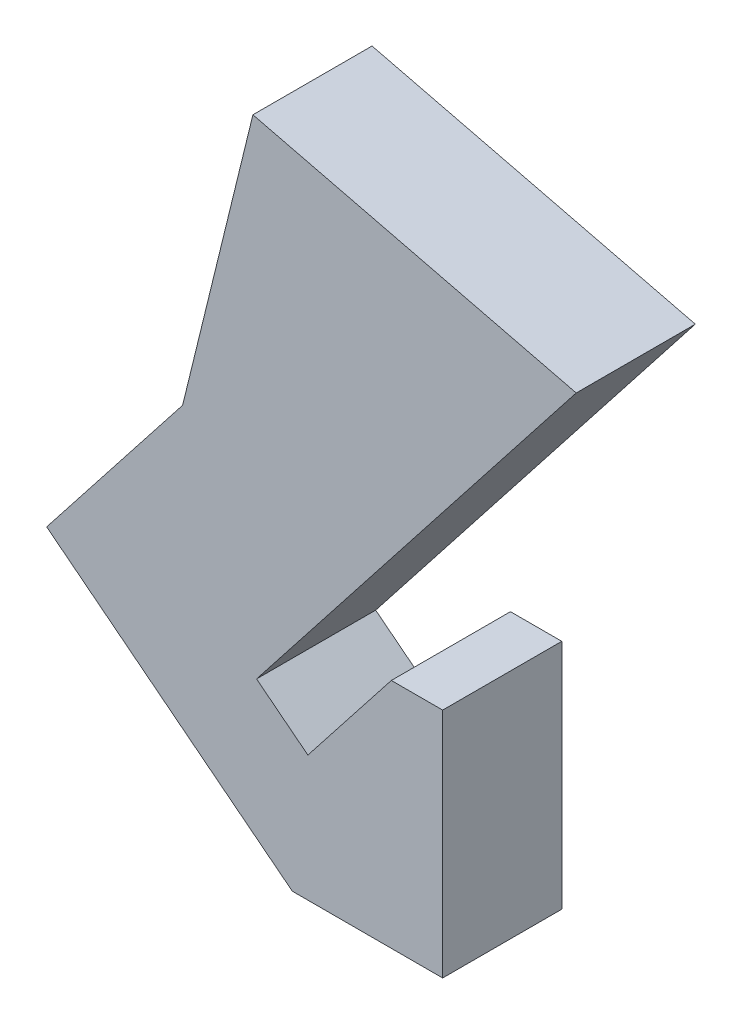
ISO-10303-21;
HEADER;
FILE_DESCRIPTION(('STEP AP214'),'2;1');
FILE_NAME('part.step','',(''),(''),'','','');
FILE_SCHEMA(('AUTOMOTIVE_DESIGN { 1 0 10303 214 1 1 1 1 }'));
ENDSEC;
DATA;
#1=APPLICATION_CONTEXT('core data for automotive mechanical design processes');
#2=APPLICATION_PROTOCOL_DEFINITION('international standard','automotive_design',2000,#1);
#3=PRODUCT_CONTEXT('',#1,'mechanical');
#4=PRODUCT('Part','Part','',(#3));
#5=PRODUCT_RELATED_PRODUCT_CATEGORY('part','',(#4));
#6=PRODUCT_DEFINITION_FORMATION('','',#4);
#7=PRODUCT_DEFINITION_CONTEXT('part definition',#1,'design');
#8=PRODUCT_DEFINITION('design','',#6,#7);
#9=PRODUCT_DEFINITION_SHAPE('','',#8);
#10=(LENGTH_UNIT() NAMED_UNIT(*) SI_UNIT(.MILLI.,.METRE.));
#11=(NAMED_UNIT(*) PLANE_ANGLE_UNIT() SI_UNIT($,.RADIAN.));
#12=(NAMED_UNIT(*) SI_UNIT($,.STERADIAN.) SOLID_ANGLE_UNIT());
#13=UNCERTAINTY_MEASURE_WITH_UNIT(LENGTH_MEASURE(1.E-05),#10,'distance_accuracy_value','');
#14=(GEOMETRIC_REPRESENTATION_CONTEXT(3) GLOBAL_UNCERTAINTY_ASSIGNED_CONTEXT((#13)) GLOBAL_UNIT_ASSIGNED_CONTEXT((#10,
#11,#12)) REPRESENTATION_CONTEXT('',''));
#15=CARTESIAN_POINT('',(0.,0.,0.));
#16=DIRECTION('',(0.,0.,1.));
#17=DIRECTION('',(1.,0.,0.));
#18=AXIS2_PLACEMENT_3D('',#15,#16,#17);
#19=CARTESIAN_POINT('',(0.,11.3792,5.842));
#20=DIRECTION('',(-1.,0.,0.));
#21=DIRECTION('',(0.,-1.,0.));
#22=AXIS2_PLACEMENT_3D('',#19,#20,#21);
#23=PLANE('',#22);
#24=DIRECTION('',(0.,1.,0.));
#25=VECTOR('',#24,1.);
#26=CARTESIAN_POINT('',(0.,11.3792,0.));
#27=LINE('',#26,#25);
#28=CARTESIAN_POINT('',(0.,0.,0.));
#29=VERTEX_POINT('',#28);
#30=CARTESIAN_POINT('',(0.,11.3792,0.));
#31=VERTEX_POINT('',#30);
#32=EDGE_CURVE('E111',#29,#31,#27,.T.);
#33=ORIENTED_EDGE('',*,*,#32,.T.);
#34=DIRECTION('',(0.,0.,-1.));
#35=VECTOR('',#34,1.);
#36=CARTESIAN_POINT('',(0.,11.3792,5.842));
#37=LINE('',#36,#35);
#38=CARTESIAN_POINT('',(0.,11.3792,5.842));
#39=VERTEX_POINT('',#38);
#40=EDGE_CURVE('E11',#39,#31,#37,.T.);
#41=ORIENTED_EDGE('',*,*,#40,.F.);
#42=DIRECTION('',(0.,1.,0.));
#43=VECTOR('',#42,1.);
#44=CARTESIAN_POINT('',(0.,11.3792,5.842));
#45=LINE('',#44,#43);
#46=CARTESIAN_POINT('',(0.,0.,5.842));
#47=VERTEX_POINT('',#46);
#48=EDGE_CURVE('E142',#47,#39,#45,.T.);
#49=ORIENTED_EDGE('',*,*,#48,.F.);
#50=DIRECTION('',(0.,0.,-1.));
#51=VECTOR('',#50,1.);
#52=CARTESIAN_POINT('',(0.,0.,5.842));
#53=LINE('',#52,#51);
#54=EDGE_CURVE('E124',#47,#29,#53,.T.);
#55=ORIENTED_EDGE('',*,*,#54,.T.);
#56=EDGE_LOOP('',(#33,#41,#49,#55));
#57=FACE_BOUND('',#56,.T.);
#58=ADVANCED_FACE('F31',(#57),#23,.F.);
#59=CARTESIAN_POINT('',(-2.51742702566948,11.3792,5.842));
#60=DIRECTION('',(0.,-1.,0.));
#61=DIRECTION('',(1.,0.,0.));
#62=AXIS2_PLACEMENT_3D('',#59,#60,#61);
#63=PLANE('',#62);
#64=DIRECTION('',(-1.,0.,0.));
#65=VECTOR('',#64,1.);
#66=CARTESIAN_POINT('',(-2.51742702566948,11.3792,0.));
#67=LINE('',#66,#65);
#68=CARTESIAN_POINT('',(-2.51742702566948,11.3792,0.));
#69=VERTEX_POINT('',#68);
#70=EDGE_CURVE('E107',#31,#69,#67,.T.);
#71=ORIENTED_EDGE('',*,*,#70,.T.);
#72=DIRECTION('',(0.,0.,-1.));
#73=VECTOR('',#72,1.);
#74=CARTESIAN_POINT('',(-2.51742702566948,11.3792,5.842));
#75=LINE('',#74,#73);
#76=CARTESIAN_POINT('',(-2.51742702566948,11.3792,5.842));
#77=VERTEX_POINT('',#76);
#78=EDGE_CURVE('E38',#77,#69,#75,.T.);
#79=ORIENTED_EDGE('',*,*,#78,.F.);
#80=DIRECTION('',(-1.,0.,0.));
#81=VECTOR('',#80,1.);
#82=CARTESIAN_POINT('',(-2.51742702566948,11.3792,5.842));
#83=LINE('',#82,#81);
#84=EDGE_CURVE('E120',#39,#77,#83,.T.);
#85=ORIENTED_EDGE('',*,*,#84,.F.);
#86=ORIENTED_EDGE('',*,*,#40,.T.);
#87=EDGE_LOOP('',(#71,#79,#85,#86));
#88=FACE_BOUND('',#87,.T.);
#89=ADVANCED_FACE('F119',(#88),#63,.F.);
#90=CARTESIAN_POINT('',(-6.60909719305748,6.1631498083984,5.842));
#91=DIRECTION('',(0.786805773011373,-0.617200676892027,0.));
#92=DIRECTION('',(0.617200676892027,0.786805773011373,0.));
#93=AXIS2_PLACEMENT_3D('',#90,#91,#92);
#94=PLANE('',#93);
#95=DIRECTION('',(-0.617200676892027,-0.786805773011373,0.));
#96=VECTOR('',#95,1.);
#97=CARTESIAN_POINT('',(-6.60909719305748,6.1631498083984,0.));
#98=LINE('',#97,#96);
#99=CARTESIAN_POINT('',(-6.60909719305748,6.1631498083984,0.));
#100=VERTEX_POINT('',#99);
#101=EDGE_CURVE('E113',#69,#100,#98,.T.);
#102=ORIENTED_EDGE('',*,*,#101,.T.);
#103=DIRECTION('',(0.,0.,-1.));
#104=VECTOR('',#103,1.);
#105=CARTESIAN_POINT('',(-6.60909719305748,6.1631498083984,5.842));
#106=LINE('',#105,#104);
#107=CARTESIAN_POINT('',(-6.60909719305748,6.1631498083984,5.842));
#108=VERTEX_POINT('',#107);
#109=EDGE_CURVE('E178',#108,#100,#106,.T.);
#110=ORIENTED_EDGE('',*,*,#109,.F.);
#111=DIRECTION('',(-0.617200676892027,-0.786805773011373,0.));
#112=VECTOR('',#111,1.);
#113=CARTESIAN_POINT('',(-6.60909719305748,6.1631498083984,5.842));
#114=LINE('',#113,#112);
#115=EDGE_CURVE('E145',#77,#108,#114,.T.);
#116=ORIENTED_EDGE('',*,*,#115,.F.);
#117=ORIENTED_EDGE('',*,*,#78,.T.);
#118=EDGE_LOOP('',(#102,#110,#116,#117));
#119=FACE_BOUND('',#118,.T.);
#120=ADVANCED_FACE('F182',(#119),#94,.F.);
#121=CARTESIAN_POINT('',(-9.12719038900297,8.13843885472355,5.842));
#122=DIRECTION('',(-0.617200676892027,-0.786805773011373,0.));
#123=DIRECTION('',(0.786805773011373,-0.617200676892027,0.));
#124=AXIS2_PLACEMENT_3D('',#121,#122,#123);
#125=PLANE('',#124);
#126=DIRECTION('',(-0.786805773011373,0.617200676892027,0.));
#127=VECTOR('',#126,1.);
#128=CARTESIAN_POINT('',(-9.12719038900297,8.13843885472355,0.));
#129=LINE('',#128,#127);
#130=CARTESIAN_POINT('',(-9.12719038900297,8.13843885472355,0.));
#131=VERTEX_POINT('',#130);
#132=EDGE_CURVE('E128',#100,#131,#129,.T.);
#133=ORIENTED_EDGE('',*,*,#132,.T.);
#134=DIRECTION('',(0.,0.,-1.));
#135=VECTOR('',#134,1.);
#136=CARTESIAN_POINT('',(-9.12719038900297,8.13843885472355,5.842));
#137=LINE('',#136,#135);
#138=CARTESIAN_POINT('',(-9.12719038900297,8.13843885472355,5.842));
#139=VERTEX_POINT('',#138);
#140=EDGE_CURVE('E175',#139,#131,#137,.T.);
#141=ORIENTED_EDGE('',*,*,#140,.F.);
#142=DIRECTION('',(-0.786805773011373,0.617200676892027,0.));
#143=VECTOR('',#142,1.);
#144=CARTESIAN_POINT('',(-9.12719038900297,8.13843885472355,5.842));
#145=LINE('',#144,#143);
#146=EDGE_CURVE('E147',#108,#139,#145,.T.);
#147=ORIENTED_EDGE('',*,*,#146,.F.);
#148=ORIENTED_EDGE('',*,*,#109,.T.);
#149=EDGE_LOOP('',(#133,#141,#147,#148));
#150=FACE_BOUND('',#149,.T.);
#151=ADVANCED_FACE('F190',(#150),#125,.F.);
#152=CARTESIAN_POINT('',(6.54970680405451,28.1233054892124,5.842));
#153=DIRECTION('',(-0.786805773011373,0.617200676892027,0.));
#154=DIRECTION('',(-0.617200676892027,-0.786805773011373,0.));
#155=AXIS2_PLACEMENT_3D('',#152,#153,#154);
#156=PLANE('',#155);
#157=DIRECTION('',(0.617200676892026,0.786805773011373,0.));
#158=VECTOR('',#157,1.);
#159=CARTESIAN_POINT('',(6.54970680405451,28.1233054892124,0.));
#160=LINE('',#159,#158);
#161=CARTESIAN_POINT('',(6.54970680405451,28.1233054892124,0.));
#162=VERTEX_POINT('',#161);
#163=EDGE_CURVE('E130',#131,#162,#160,.T.);
#164=ORIENTED_EDGE('',*,*,#163,.T.);
#165=DIRECTION('',(0.,0.,-1.));
#166=VECTOR('',#165,1.);
#167=CARTESIAN_POINT('',(6.54970680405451,28.1233054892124,5.842));
#168=LINE('',#167,#166);
#169=CARTESIAN_POINT('',(6.54970680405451,28.1233054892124,5.842));
#170=VERTEX_POINT('',#169);
#171=EDGE_CURVE('E172',#170,#162,#168,.T.);
#172=ORIENTED_EDGE('',*,*,#171,.F.);
#173=DIRECTION('',(0.617200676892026,0.786805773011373,0.));
#174=VECTOR('',#173,1.);
#175=CARTESIAN_POINT('',(6.54970680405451,28.1233054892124,5.842));
#176=LINE('',#175,#174);
#177=EDGE_CURVE('E149',#139,#170,#176,.T.);
#178=ORIENTED_EDGE('',*,*,#177,.F.);
#179=ORIENTED_EDGE('',*,*,#140,.T.);
#180=EDGE_LOOP('',(#164,#172,#178,#179));
#181=FACE_BOUND('',#180,.T.);
#182=ADVANCED_FACE('F193',(#181),#156,.F.);
#183=CARTESIAN_POINT('',(-9.30583414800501,32.0104649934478,5.842));
#184=DIRECTION('',(-0.238109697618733,-0.971238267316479,0.));
#185=DIRECTION('',(0.971238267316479,-0.238109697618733,0.));
#186=AXIS2_PLACEMENT_3D('',#183,#184,#185);
#187=PLANE('',#186);
#188=DIRECTION('',(-0.971238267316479,0.238109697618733,0.));
#189=VECTOR('',#188,1.);
#190=CARTESIAN_POINT('',(-9.30583414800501,32.0104649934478,0.));
#191=LINE('',#190,#189);
#192=CARTESIAN_POINT('',(-9.30583414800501,32.0104649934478,0.));
#193=VERTEX_POINT('',#192);
#194=EDGE_CURVE('E132',#162,#193,#191,.T.);
#195=ORIENTED_EDGE('',*,*,#194,.T.);
#196=DIRECTION('',(0.,0.,-1.));
#197=VECTOR('',#196,1.);
#198=CARTESIAN_POINT('',(-9.30583414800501,32.0104649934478,5.842));
#199=LINE('',#198,#197);
#200=CARTESIAN_POINT('',(-9.30583414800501,32.0104649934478,5.842));
#201=VERTEX_POINT('',#200);
#202=EDGE_CURVE('E169',#201,#193,#199,.T.);
#203=ORIENTED_EDGE('',*,*,#202,.F.);
#204=DIRECTION('',(-0.971238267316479,0.238109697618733,0.));
#205=VECTOR('',#204,1.);
#206=CARTESIAN_POINT('',(-9.30583414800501,32.0104649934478,5.842));
#207=LINE('',#206,#205);
#208=EDGE_CURVE('E151',#170,#201,#207,.T.);
#209=ORIENTED_EDGE('',*,*,#208,.F.);
#210=ORIENTED_EDGE('',*,*,#171,.T.);
#211=EDGE_LOOP('',(#195,#203,#209,#210));
#212=FACE_BOUND('',#211,.T.);
#213=ADVANCED_FACE('F198',(#212),#187,.F.);
#214=CARTESIAN_POINT('',(-12.753186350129,17.9488773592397,5.842));
#215=DIRECTION('',(0.971238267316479,-0.238109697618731,0.));
#216=DIRECTION('',(0.238109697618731,0.971238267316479,0.));
#217=AXIS2_PLACEMENT_3D('',#214,#215,#216);
#218=PLANE('',#217);
#219=DIRECTION('',(-0.238109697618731,-0.971238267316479,0.));
#220=VECTOR('',#219,1.);
#221=CARTESIAN_POINT('',(-12.753186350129,17.9488773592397,0.));
#222=LINE('',#221,#220);
#223=CARTESIAN_POINT('',(-12.753186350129,17.9488773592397,0.));
#224=VERTEX_POINT('',#223);
#225=EDGE_CURVE('E134',#193,#224,#222,.T.);
#226=ORIENTED_EDGE('',*,*,#225,.T.);
#227=DIRECTION('',(0.,0.,-1.));
#228=VECTOR('',#227,1.);
#229=CARTESIAN_POINT('',(-12.753186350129,17.9488773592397,5.842));
#230=LINE('',#229,#228);
#231=CARTESIAN_POINT('',(-12.753186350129,17.9488773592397,5.842));
#232=VERTEX_POINT('',#231);
#233=EDGE_CURVE('E166',#232,#224,#230,.T.);
#234=ORIENTED_EDGE('',*,*,#233,.F.);
#235=DIRECTION('',(-0.238109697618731,-0.971238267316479,0.));
#236=VECTOR('',#235,1.);
#237=CARTESIAN_POINT('',(-12.753186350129,17.9488773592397,5.842));
#238=LINE('',#237,#236);
#239=EDGE_CURVE('E153',#201,#232,#238,.T.);
#240=ORIENTED_EDGE('',*,*,#239,.F.);
#241=ORIENTED_EDGE('',*,*,#202,.T.);
#242=EDGE_LOOP('',(#226,#234,#240,#241));
#243=FACE_BOUND('',#242,.T.);
#244=ADVANCED_FACE('F204',(#243),#218,.F.);
#245=CARTESIAN_POINT('',(-19.4205237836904,9.44937342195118,5.842));
#246=DIRECTION('',(0.786805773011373,-0.617200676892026,0.));
#247=DIRECTION('',(0.617200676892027,0.786805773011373,0.));
#248=AXIS2_PLACEMENT_3D('',#245,#246,#247);
#249=PLANE('',#248);
#250=DIRECTION('',(-0.617200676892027,-0.786805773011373,0.));
#251=VECTOR('',#250,1.);
#252=CARTESIAN_POINT('',(-19.4205237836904,9.44937342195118,0.));
#253=LINE('',#252,#251);
#254=CARTESIAN_POINT('',(-19.4205237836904,9.44937342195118,0.));
#255=VERTEX_POINT('',#254);
#256=EDGE_CURVE('E136',#224,#255,#253,.T.);
#257=ORIENTED_EDGE('',*,*,#256,.T.);
#258=DIRECTION('',(0.,0.,-1.));
#259=VECTOR('',#258,1.);
#260=CARTESIAN_POINT('',(-19.4205237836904,9.44937342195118,5.842));
#261=LINE('',#260,#259);
#262=CARTESIAN_POINT('',(-19.4205237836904,9.44937342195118,5.842));
#263=VERTEX_POINT('',#262);
#264=EDGE_CURVE('E163',#263,#255,#261,.T.);
#265=ORIENTED_EDGE('',*,*,#264,.F.);
#266=DIRECTION('',(-0.617200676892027,-0.786805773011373,0.));
#267=VECTOR('',#266,1.);
#268=CARTESIAN_POINT('',(-19.4205237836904,9.44937342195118,5.842));
#269=LINE('',#268,#267);
#270=EDGE_CURVE('E155',#232,#263,#269,.T.);
#271=ORIENTED_EDGE('',*,*,#270,.F.);
#272=ORIENTED_EDGE('',*,*,#233,.T.);
#273=EDGE_LOOP('',(#257,#265,#271,#272));
#274=FACE_BOUND('',#273,.T.);
#275=ADVANCED_FACE('F208',(#274),#249,.F.);
#276=CARTESIAN_POINT('',(-7.37448780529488,0.,5.842));
#277=DIRECTION('',(0.617200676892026,0.786805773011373,0.));
#278=DIRECTION('',(-0.786805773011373,0.617200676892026,0.));
#279=AXIS2_PLACEMENT_3D('',#276,#277,#278);
#280=PLANE('',#279);
#281=DIRECTION('',(0.786805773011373,-0.617200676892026,0.));
#282=VECTOR('',#281,1.);
#283=CARTESIAN_POINT('',(-7.37448780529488,0.,0.));
#284=LINE('',#283,#282);
#285=CARTESIAN_POINT('',(-7.37448780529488,0.,0.));
#286=VERTEX_POINT('',#285);
#287=EDGE_CURVE('E138',#255,#286,#284,.T.);
#288=ORIENTED_EDGE('',*,*,#287,.T.);
#289=DIRECTION('',(0.,0.,-1.));
#290=VECTOR('',#289,1.);
#291=CARTESIAN_POINT('',(-7.37448780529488,0.,5.842));
#292=LINE('',#291,#290);
#293=CARTESIAN_POINT('',(-7.37448780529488,0.,5.842));
#294=VERTEX_POINT('',#293);
#295=EDGE_CURVE('E160',#294,#286,#292,.T.);
#296=ORIENTED_EDGE('',*,*,#295,.F.);
#297=DIRECTION('',(0.786805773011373,-0.617200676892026,0.));
#298=VECTOR('',#297,1.);
#299=CARTESIAN_POINT('',(-7.37448780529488,0.,5.842));
#300=LINE('',#299,#298);
#301=EDGE_CURVE('E50',#263,#294,#300,.T.);
#302=ORIENTED_EDGE('',*,*,#301,.F.);
#303=ORIENTED_EDGE('',*,*,#264,.T.);
#304=EDGE_LOOP('',(#288,#296,#302,#303));
#305=FACE_BOUND('',#304,.T.);
#306=ADVANCED_FACE('F211',(#305),#280,.F.);
#307=CARTESIAN_POINT('',(0.,0.,5.842));
#308=DIRECTION('',(0.,1.,0.));
#309=DIRECTION('',(0.,0.,1.));
#310=AXIS2_PLACEMENT_3D('',#307,#308,#309);
#311=PLANE('',#310);
#312=DIRECTION('',(1.,0.,0.));
#313=VECTOR('',#312,1.);
#314=CARTESIAN_POINT('',(0.,0.,0.));
#315=LINE('',#314,#313);
#316=EDGE_CURVE('E140',#286,#29,#315,.T.);
#317=ORIENTED_EDGE('',*,*,#316,.T.);
#318=ORIENTED_EDGE('',*,*,#54,.F.);
#319=DIRECTION('',(1.,0.,0.));
#320=VECTOR('',#319,1.);
#321=CARTESIAN_POINT('',(0.,0.,5.842));
#322=LINE('',#321,#320);
#323=EDGE_CURVE('E45',#294,#47,#322,.T.);
#324=ORIENTED_EDGE('',*,*,#323,.F.);
#325=ORIENTED_EDGE('',*,*,#295,.T.);
#326=EDGE_LOOP('',(#317,#318,#324,#325));
#327=FACE_BOUND('',#326,.T.);
#328=ADVANCED_FACE('F213',(#327),#311,.F.);
#329=CARTESIAN_POINT('',(0.,0.,5.842));
#330=DIRECTION('',(0.,0.,-1.));
#331=DIRECTION('',(-1.,0.,0.));
#332=AXIS2_PLACEMENT_3D('',#329,#330,#331);
#333=PLANE('',#332);
#334=ORIENTED_EDGE('',*,*,#48,.T.);
#335=ORIENTED_EDGE('',*,*,#84,.T.);
#336=ORIENTED_EDGE('',*,*,#115,.T.);
#337=ORIENTED_EDGE('',*,*,#146,.T.);
#338=ORIENTED_EDGE('',*,*,#177,.T.);
#339=ORIENTED_EDGE('',*,*,#208,.T.);
#340=ORIENTED_EDGE('',*,*,#239,.T.);
#341=ORIENTED_EDGE('',*,*,#270,.T.);
#342=ORIENTED_EDGE('',*,*,#301,.T.);
#343=ORIENTED_EDGE('',*,*,#323,.T.);
#344=EDGE_LOOP('',(#334,#335,#336,#337,#338,#339,#340,#341,#342,#343));
#345=FACE_BOUND('',#344,.T.);
#346=ADVANCED_FACE('F185',(#345),#333,.F.);
#347=CARTESIAN_POINT('',(0.,0.,0.));
#348=DIRECTION('',(0.,0.,-1.));
#349=DIRECTION('',(-1.,0.,0.));
#350=AXIS2_PLACEMENT_3D('',#347,#348,#349);
#351=PLANE('',#350);
#352=ORIENTED_EDGE('',*,*,#32,.F.);
#353=ORIENTED_EDGE('',*,*,#316,.F.);
#354=ORIENTED_EDGE('',*,*,#287,.F.);
#355=ORIENTED_EDGE('',*,*,#256,.F.);
#356=ORIENTED_EDGE('',*,*,#225,.F.);
#357=ORIENTED_EDGE('',*,*,#194,.F.);
#358=ORIENTED_EDGE('',*,*,#163,.F.);
#359=ORIENTED_EDGE('',*,*,#132,.F.);
#360=ORIENTED_EDGE('',*,*,#101,.F.);
#361=ORIENTED_EDGE('',*,*,#70,.F.);
#362=EDGE_LOOP('',(#352,#353,#354,#355,#356,#357,#358,#359,#360,#361));
#363=FACE_BOUND('',#362,.T.);
#364=ADVANCED_FACE('F108',(#363),#351,.T.);
#365=CLOSED_SHELL('',(#58,#89,#120,#151,#182,#213,#244,#275,#306,#328,#346,#364));
#366=MANIFOLD_SOLID_BREP('B2',#365);
#367=ADVANCED_BREP_SHAPE_REPRESENTATION('',(#18,#366),#14);
#368=SHAPE_DEFINITION_REPRESENTATION(#9,#367);
ENDSEC;
END-ISO-10303-21;
